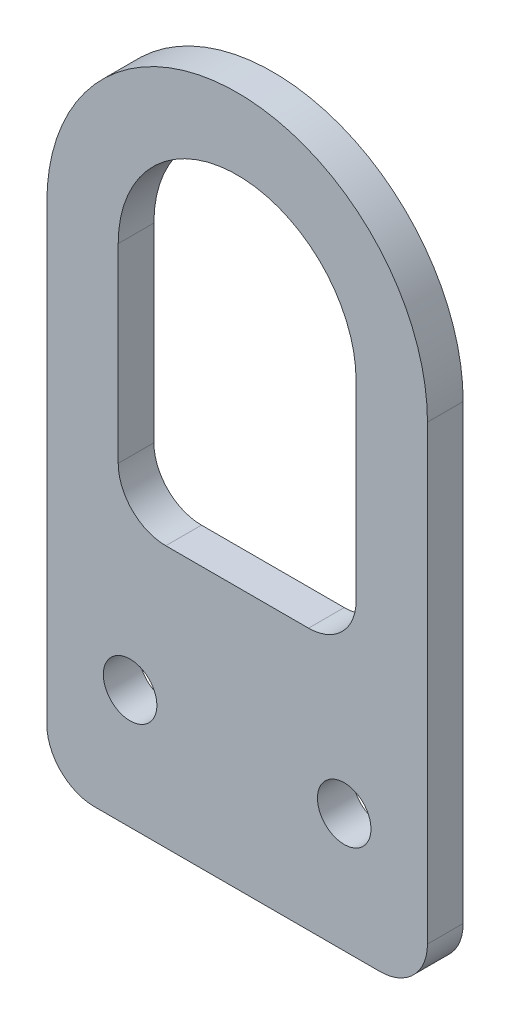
from build123d import *

# Parameters (mm, degrees)
SKETCH1_R      = 7.14375
EXTRUDE1_DEPTH = 9.525
EXTRUDE2_DEPTH = 9.525


with BuildPart() as part:
    # Sketch1 → Extrude1 (new body)
    with BuildSketch(Plane.XY):
        with BuildLine():
            Line((-50.8, -103.717375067), (50.8, -103.717375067))
            Line((50.8, -103.717375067), (50.8, -139.7))
            ThreePointArc((50.8, -139.7), (47.080256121, -148.680256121), (38.1, -152.4))
            Line((38.1, -152.4), (-38.1, -152.4))
            ThreePointArc((-38.1, -152.4), (-47.080256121, -148.680256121), (-50.8, -139.7))
            Line((-50.8, -139.7), (-50.8, -103.717375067))
        make_face()
        with Locations(Location((-28.575, -120.65, 0), (0, 0, 180))):
            Circle(SKETCH1_R, mode=Mode.SUBTRACT)
        with Locations(Location((28.575, -120.65, 0), (0, 0, 180))):
            Circle(SKETCH1_R, mode=Mode.SUBTRACT)
    extrude(amount=EXTRUDE1_DEPTH)

    # Sketch3 → Extrude2 (add)
    with BuildSketch(Plane.XY.offset(9.525)):
        with BuildLine():
            Line((50.8, -19.05), (50.8, -103.717375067))
            Line((50.8, -103.717375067), (-50.8, -103.717375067))
            Line((-50.8, -103.717375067), (-50.8, -19.05))
            ThreePointArc((-50.8, -19.05), (0, 31.75), (50.8, -19.05))
        make_face()
        with BuildLine():
            Line((-19.05, -82.55), (19.05, -82.55))
            ThreePointArc((19.05, -82.55), (28.030256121, -78.830256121), (31.75, -69.85))
            Line((31.75, -69.85), (31.75, -19.05))
            ThreePointArc((31.75, -19.05), (0, 12.7), (-31.75, -19.05))
            Line((-31.75, -19.05), (-31.75, -69.85))
            ThreePointArc((-31.75, -69.85), (-28.030256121, -78.830256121), (-19.05, -82.55))
        make_face(mode=Mode.SUBTRACT)
    extrude(amount=-EXTRUDE2_DEPTH)


solid = part.part
